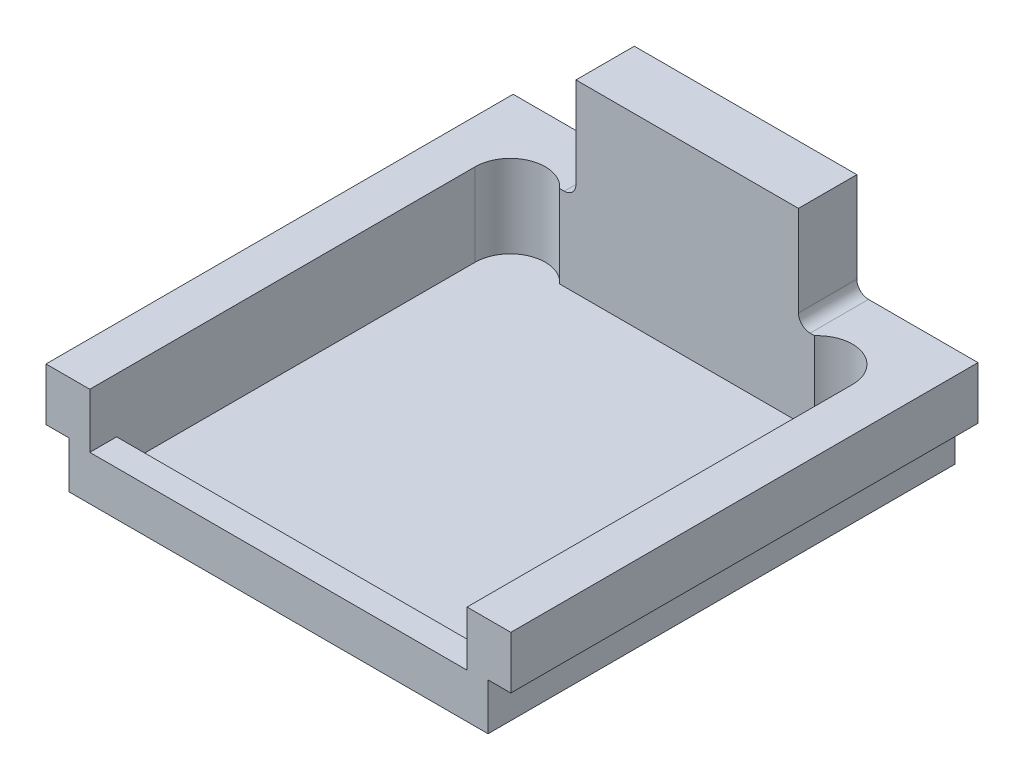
ISO-10303-21;
HEADER;
FILE_DESCRIPTION(('STEP AP214'),'2;1');
FILE_NAME('part.step','',(''),(''),'','','');
FILE_SCHEMA(('AUTOMOTIVE_DESIGN { 1 0 10303 214 1 1 1 1 }'));
ENDSEC;
DATA;
#1=APPLICATION_CONTEXT('core data for automotive mechanical design processes');
#2=APPLICATION_PROTOCOL_DEFINITION('international standard','automotive_design',2000,#1);
#3=PRODUCT_CONTEXT('',#1,'mechanical');
#4=PRODUCT('Part','Part','',(#3));
#5=PRODUCT_RELATED_PRODUCT_CATEGORY('part','',(#4));
#6=PRODUCT_DEFINITION_FORMATION('','',#4);
#7=PRODUCT_DEFINITION_CONTEXT('part definition',#1,'design');
#8=PRODUCT_DEFINITION('design','',#6,#7);
#9=PRODUCT_DEFINITION_SHAPE('','',#8);
#10=(LENGTH_UNIT() NAMED_UNIT(*) SI_UNIT(.MILLI.,.METRE.));
#11=(NAMED_UNIT(*) PLANE_ANGLE_UNIT() SI_UNIT($,.RADIAN.));
#12=(NAMED_UNIT(*) SI_UNIT($,.STERADIAN.) SOLID_ANGLE_UNIT());
#13=UNCERTAINTY_MEASURE_WITH_UNIT(LENGTH_MEASURE(1.E-05),#10,'distance_accuracy_value','');
#14=(GEOMETRIC_REPRESENTATION_CONTEXT(3) GLOBAL_UNCERTAINTY_ASSIGNED_CONTEXT((#13)) GLOBAL_UNIT_ASSIGNED_CONTEXT((#10,
#11,#12)) REPRESENTATION_CONTEXT('',''));
#15=CARTESIAN_POINT('',(0.,0.,0.));
#16=DIRECTION('',(0.,0.,1.));
#17=DIRECTION('',(1.,0.,0.));
#18=AXIS2_PLACEMENT_3D('',#15,#16,#17);
#19=CARTESIAN_POINT('',(0.,1.42,21.3132343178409));
#20=DIRECTION('',(0.,1.,0.));
#21=DIRECTION('',(0.,0.,1.));
#22=AXIS2_PLACEMENT_3D('',#19,#20,#21);
#23=PLANE('',#22);
#24=CARTESIAN_POINT('',(-13.15,1.42,7.00000000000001));
#25=DIRECTION('',(0.,-1.,0.));
#26=DIRECTION('',(0.,0.,-1.));
#27=AXIS2_PLACEMENT_3D('',#24,#25,#26);
#28=CIRCLE('',#27,3.);
#29=CARTESIAN_POINT('',(-10.9139320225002,1.42,5.));
#30=VERTEX_POINT('',#29);
#31=CARTESIAN_POINT('',(-16.15,1.42,7.00000000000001));
#32=VERTEX_POINT('',#31);
#33=EDGE_CURVE('E226',#30,#32,#28,.F.);
#34=ORIENTED_EDGE('',*,*,#33,.T.);
#35=DIRECTION('',(0.,0.,1.));
#36=VECTOR('',#35,1.);
#37=CARTESIAN_POINT('',(-16.15,1.42,7.00000000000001));
#38=LINE('',#37,#36);
#39=CARTESIAN_POINT('',(-16.15,1.42,37.7));
#40=VERTEX_POINT('',#39);
#41=EDGE_CURVE('E201',#32,#40,#38,.T.);
#42=ORIENTED_EDGE('',*,*,#41,.T.);
#43=DIRECTION('',(1.,0.,0.));
#44=VECTOR('',#43,1.);
#45=CARTESIAN_POINT('',(-16.15,1.42,37.7));
#46=LINE('',#45,#44);
#47=CARTESIAN_POINT('',(16.15,1.42,37.7));
#48=VERTEX_POINT('',#47);
#49=EDGE_CURVE('E166',#40,#48,#46,.T.);
#50=ORIENTED_EDGE('',*,*,#49,.T.);
#51=DIRECTION('',(0.,0.,-1.));
#52=VECTOR('',#51,1.);
#53=CARTESIAN_POINT('',(16.15,1.42,40.));
#54=LINE('',#53,#52);
#55=CARTESIAN_POINT('',(16.15,1.42,7.));
#56=VERTEX_POINT('',#55);
#57=EDGE_CURVE('E162',#48,#56,#54,.T.);
#58=ORIENTED_EDGE('',*,*,#57,.T.);
#59=CARTESIAN_POINT('',(13.15,1.42,7.));
#60=DIRECTION('',(0.,-1.,0.));
#61=DIRECTION('',(0.,0.,-1.));
#62=AXIS2_PLACEMENT_3D('',#59,#60,#61);
#63=CIRCLE('',#62,3.);
#64=CARTESIAN_POINT('',(10.9139320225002,1.42,5.));
#65=VERTEX_POINT('',#64);
#66=EDGE_CURVE('E19',#56,#65,#63,.F.);
#67=ORIENTED_EDGE('',*,*,#66,.T.);
#68=DIRECTION('',(-1.,0.,0.));
#69=VECTOR('',#68,1.);
#70=CARTESIAN_POINT('',(10.9139320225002,1.42,5.));
#71=LINE('',#70,#69);
#72=EDGE_CURVE('E200',#65,#30,#71,.T.);
#73=ORIENTED_EDGE('',*,*,#72,.T.);
#74=EDGE_LOOP('',(#34,#42,#50,#58,#67,#73));
#75=FACE_BOUND('',#74,.T.);
#76=ADVANCED_FACE('F16',(#75),#23,.T.);
#77=CARTESIAN_POINT('',(-16.15,3.82,37.7));
#78=DIRECTION('',(0.,0.,1.));
#79=DIRECTION('',(1.,0.,0.));
#80=AXIS2_PLACEMENT_3D('',#77,#78,#79);
#81=PLANE('',#80);
#82=DIRECTION('',(0.,1.,0.));
#83=VECTOR('',#82,1.);
#84=CARTESIAN_POINT('',(-16.15,17.25,37.7));
#85=LINE('',#84,#83);
#86=CARTESIAN_POINT('',(-16.15,3.82,37.7));
#87=VERTEX_POINT('',#86);
#88=EDGE_CURVE('E203',#40,#87,#85,.T.);
#89=ORIENTED_EDGE('',*,*,#88,.T.);
#90=DIRECTION('',(1.,0.,0.));
#91=VECTOR('',#90,1.);
#92=CARTESIAN_POINT('',(0.,3.82,37.7));
#93=LINE('',#92,#91);
#94=CARTESIAN_POINT('',(16.15,3.82,37.7));
#95=VERTEX_POINT('',#94);
#96=EDGE_CURVE('E185',#95,#87,#93,.F.);
#97=ORIENTED_EDGE('',*,*,#96,.F.);
#98=DIRECTION('',(0.,1.,0.));
#99=VECTOR('',#98,1.);
#100=CARTESIAN_POINT('',(16.15,17.25,37.7));
#101=LINE('',#100,#99);
#102=EDGE_CURVE('E172',#95,#48,#101,.F.);
#103=ORIENTED_EDGE('',*,*,#102,.T.);
#104=ORIENTED_EDGE('',*,*,#49,.F.);
#105=EDGE_LOOP('',(#89,#97,#103,#104));
#106=FACE_BOUND('',#105,.T.);
#107=ADVANCED_FACE('F399',(#106),#81,.F.);
#108=CARTESIAN_POINT('',(13.15,17.25,7.));
#109=DIRECTION('',(0.,-1.,0.));
#110=DIRECTION('',(0.,0.,-1.));
#111=AXIS2_PLACEMENT_3D('',#108,#109,#110);
#112=CYLINDRICAL_SURFACE('',#111,3.);
#113=DIRECTION('',(0.,1.,0.));
#114=VECTOR('',#113,1.);
#115=CARTESIAN_POINT('',(10.9139320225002,17.25,5.));
#116=LINE('',#115,#114);
#117=CARTESIAN_POINT('',(10.9139320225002,8.5,5.));
#118=VERTEX_POINT('',#117);
#119=EDGE_CURVE('E178',#118,#65,#116,.F.);
#120=ORIENTED_EDGE('',*,*,#119,.T.);
#121=ORIENTED_EDGE('',*,*,#66,.F.);
#122=DIRECTION('',(0.,1.,0.));
#123=VECTOR('',#122,1.);
#124=CARTESIAN_POINT('',(16.15,17.25,7.));
#125=LINE('',#124,#123);
#126=CARTESIAN_POINT('',(16.15,8.5,7.));
#127=VERTEX_POINT('',#126);
#128=EDGE_CURVE('E171',#56,#127,#125,.T.);
#129=ORIENTED_EDGE('',*,*,#128,.T.);
#130=CARTESIAN_POINT('',(13.15,8.5,7.));
#131=DIRECTION('',(0.,-1.,0.));
#132=DIRECTION('',(0.,0.,-1.));
#133=AXIS2_PLACEMENT_3D('',#130,#131,#132);
#134=CIRCLE('',#133,3.);
#135=EDGE_CURVE('E219',#118,#127,#134,.T.);
#136=ORIENTED_EDGE('',*,*,#135,.F.);
#137=EDGE_LOOP('',(#120,#121,#129,#136));
#138=FACE_BOUND('',#137,.T.);
#139=ADVANCED_FACE('F175',(#138),#112,.F.);
#140=CARTESIAN_POINT('',(10.525,9.5,0.));
#141=DIRECTION('',(0.,0.,1.));
#142=DIRECTION('',(1.,0.,0.));
#143=AXIS2_PLACEMENT_3D('',#140,#141,#142);
#144=CYLINDRICAL_SURFACE('',#143,1.);
#145=DIRECTION('',(0.,0.,1.));
#146=VECTOR('',#145,1.);
#147=CARTESIAN_POINT('',(10.525,8.5,0.));
#148=LINE('',#147,#146);
#149=CARTESIAN_POINT('',(10.525,8.5,0.));
#150=VERTEX_POINT('',#149);
#151=CARTESIAN_POINT('',(10.525,8.5,5.));
#152=VERTEX_POINT('',#151);
#153=EDGE_CURVE('E244',#150,#152,#148,.T.);
#154=ORIENTED_EDGE('',*,*,#153,.F.);
#155=CARTESIAN_POINT('',(10.525,9.5,0.));
#156=DIRECTION('',(0.,0.,1.));
#157=DIRECTION('',(1.,0.,0.));
#158=AXIS2_PLACEMENT_3D('',#155,#156,#157);
#159=CIRCLE('',#158,1.);
#160=CARTESIAN_POINT('',(9.525,9.5,0.));
#161=VERTEX_POINT('',#160);
#162=EDGE_CURVE('E180',#161,#150,#159,.T.);
#163=ORIENTED_EDGE('',*,*,#162,.F.);
#164=DIRECTION('',(0.,0.,-1.));
#165=VECTOR('',#164,1.);
#166=CARTESIAN_POINT('',(9.525,9.5,0.));
#167=LINE('',#166,#165);
#168=CARTESIAN_POINT('',(9.525,9.5,5.));
#169=VERTEX_POINT('',#168);
#170=EDGE_CURVE('E303',#169,#161,#167,.T.);
#171=ORIENTED_EDGE('',*,*,#170,.F.);
#172=CARTESIAN_POINT('',(10.525,9.5,5.));
#173=DIRECTION('',(0.,0.,1.));
#174=DIRECTION('',(1.,0.,0.));
#175=AXIS2_PLACEMENT_3D('',#172,#173,#174);
#176=CIRCLE('',#175,1.);
#177=EDGE_CURVE('E229',#169,#152,#176,.T.);
#178=ORIENTED_EDGE('',*,*,#177,.T.);
#179=EDGE_LOOP('',(#154,#163,#171,#178));
#180=FACE_BOUND('',#179,.T.);
#181=ADVANCED_FACE('F245',(#180),#144,.F.);
#182=CARTESIAN_POINT('',(10.9139320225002,17.25,5.));
#183=DIRECTION('',(0.,0.,-1.));
#184=DIRECTION('',(-1.,0.,0.));
#185=AXIS2_PLACEMENT_3D('',#182,#183,#184);
#186=PLANE('',#185);
#187=ORIENTED_EDGE('',*,*,#177,.F.);
#188=DIRECTION('',(0.,1.,0.));
#189=VECTOR('',#188,1.);
#190=CARTESIAN_POINT('',(9.525,17.25,5.));
#191=LINE('',#190,#189);
#192=CARTESIAN_POINT('',(9.525,17.25,5.));
#193=VERTEX_POINT('',#192);
#194=EDGE_CURVE('E249',#193,#169,#191,.F.);
#195=ORIENTED_EDGE('',*,*,#194,.F.);
#196=DIRECTION('',(1.,0.,0.));
#197=VECTOR('',#196,1.);
#198=CARTESIAN_POINT('',(-9.525,17.25,5.));
#199=LINE('',#198,#197);
#200=CARTESIAN_POINT('',(-9.525,17.25,5.));
#201=VERTEX_POINT('',#200);
#202=EDGE_CURVE('E302',#201,#193,#199,.T.);
#203=ORIENTED_EDGE('',*,*,#202,.F.);
#204=DIRECTION('',(0.,1.,0.));
#205=VECTOR('',#204,1.);
#206=CARTESIAN_POINT('',(-9.525,9.5,5.));
#207=LINE('',#206,#205);
#208=CARTESIAN_POINT('',(-9.525,9.5,5.));
#209=VERTEX_POINT('',#208);
#210=EDGE_CURVE('E296',#209,#201,#207,.T.);
#211=ORIENTED_EDGE('',*,*,#210,.F.);
#212=CARTESIAN_POINT('',(-10.525,9.5,5.));
#213=DIRECTION('',(0.,0.,1.));
#214=DIRECTION('',(1.,0.,0.));
#215=AXIS2_PLACEMENT_3D('',#212,#213,#214);
#216=CIRCLE('',#215,1.);
#217=CARTESIAN_POINT('',(-10.525,8.5,5.));
#218=VERTEX_POINT('',#217);
#219=EDGE_CURVE('E208',#209,#218,#216,.F.);
#220=ORIENTED_EDGE('',*,*,#219,.T.);
#221=DIRECTION('',(-1.,0.,0.));
#222=VECTOR('',#221,1.);
#223=CARTESIAN_POINT('',(10.9139320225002,8.5,5.));
#224=LINE('',#223,#222);
#225=CARTESIAN_POINT('',(-10.9139320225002,8.5,5.));
#226=VERTEX_POINT('',#225);
#227=EDGE_CURVE('E213',#226,#218,#224,.F.);
#228=ORIENTED_EDGE('',*,*,#227,.F.);
#229=DIRECTION('',(0.,-1.,0.));
#230=VECTOR('',#229,1.);
#231=CARTESIAN_POINT('',(-10.9139320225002,17.25,5.));
#232=LINE('',#231,#230);
#233=EDGE_CURVE('E228',#226,#30,#232,.T.);
#234=ORIENTED_EDGE('',*,*,#233,.T.);
#235=ORIENTED_EDGE('',*,*,#72,.F.);
#236=ORIENTED_EDGE('',*,*,#119,.F.);
#237=DIRECTION('',(1.,0.,0.));
#238=VECTOR('',#237,1.);
#239=CARTESIAN_POINT('',(10.525,8.5,5.));
#240=LINE('',#239,#238);
#241=EDGE_CURVE('E221',#152,#118,#240,.T.);
#242=ORIENTED_EDGE('',*,*,#241,.F.);
#243=EDGE_LOOP('',(#187,#195,#203,#211,#220,#228,#234,#235,#236,#242));
#244=FACE_BOUND('',#243,.T.);
#245=ADVANCED_FACE('F343',(#244),#186,.F.);
#246=CARTESIAN_POINT('',(-13.15,17.25,7.00000000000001));
#247=DIRECTION('',(0.,-1.,0.));
#248=DIRECTION('',(0.,0.,-1.));
#249=AXIS2_PLACEMENT_3D('',#246,#247,#248);
#250=CYLINDRICAL_SURFACE('',#249,3.);
#251=DIRECTION('',(0.,1.,0.));
#252=VECTOR('',#251,1.);
#253=CARTESIAN_POINT('',(-16.15,17.25,7.00000000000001));
#254=LINE('',#253,#252);
#255=CARTESIAN_POINT('',(-16.15,8.5,7.00000000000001));
#256=VERTEX_POINT('',#255);
#257=EDGE_CURVE('E204',#256,#32,#254,.F.);
#258=ORIENTED_EDGE('',*,*,#257,.T.);
#259=ORIENTED_EDGE('',*,*,#33,.F.);
#260=ORIENTED_EDGE('',*,*,#233,.F.);
#261=CARTESIAN_POINT('',(-13.15,8.5,7.00000000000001));
#262=DIRECTION('',(0.,-1.,0.));
#263=DIRECTION('',(0.,0.,-1.));
#264=AXIS2_PLACEMENT_3D('',#261,#262,#263);
#265=CIRCLE('',#264,3.);
#266=EDGE_CURVE('E214',#256,#226,#265,.T.);
#267=ORIENTED_EDGE('',*,*,#266,.F.);
#268=EDGE_LOOP('',(#258,#259,#260,#267));
#269=FACE_BOUND('',#268,.T.);
#270=ADVANCED_FACE('F389',(#269),#250,.F.);
#271=CARTESIAN_POINT('',(-10.525,9.5,0.));
#272=DIRECTION('',(0.,0.,1.));
#273=DIRECTION('',(1.,0.,0.));
#274=AXIS2_PLACEMENT_3D('',#271,#272,#273);
#275=CYLINDRICAL_SURFACE('',#274,1.);
#276=DIRECTION('',(0.,0.,1.));
#277=VECTOR('',#276,1.);
#278=CARTESIAN_POINT('',(-9.525,9.5,0.));
#279=LINE('',#278,#277);
#280=CARTESIAN_POINT('',(-9.525,9.5,0.));
#281=VERTEX_POINT('',#280);
#282=EDGE_CURVE('E282',#281,#209,#279,.T.);
#283=ORIENTED_EDGE('',*,*,#282,.F.);
#284=CARTESIAN_POINT('',(-10.525,9.5,0.));
#285=DIRECTION('',(0.,0.,1.));
#286=DIRECTION('',(1.,0.,0.));
#287=AXIS2_PLACEMENT_3D('',#284,#285,#286);
#288=CIRCLE('',#287,1.);
#289=CARTESIAN_POINT('',(-10.525,8.5,0.));
#290=VERTEX_POINT('',#289);
#291=EDGE_CURVE('E224',#290,#281,#288,.T.);
#292=ORIENTED_EDGE('',*,*,#291,.F.);
#293=DIRECTION('',(0.,0.,1.));
#294=VECTOR('',#293,1.);
#295=CARTESIAN_POINT('',(-10.525,8.5,0.));
#296=LINE('',#295,#294);
#297=EDGE_CURVE('E217',#218,#290,#296,.F.);
#298=ORIENTED_EDGE('',*,*,#297,.F.);
#299=ORIENTED_EDGE('',*,*,#219,.F.);
#300=EDGE_LOOP('',(#283,#292,#298,#299));
#301=FACE_BOUND('',#300,.T.);
#302=ADVANCED_FACE('F383',(#301),#275,.F.);
#303=CARTESIAN_POINT('',(16.15,17.25,40.));
#304=DIRECTION('',(1.,0.,0.));
#305=DIRECTION('',(0.,0.,-1.));
#306=AXIS2_PLACEMENT_3D('',#303,#304,#305);
#307=PLANE('',#306);
#308=ORIENTED_EDGE('',*,*,#128,.F.);
#309=ORIENTED_EDGE('',*,*,#57,.F.);
#310=ORIENTED_EDGE('',*,*,#102,.F.);
#311=DIRECTION('',(0.,0.,1.));
#312=VECTOR('',#311,1.);
#313=CARTESIAN_POINT('',(16.15,3.82,22.4644988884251));
#314=LINE('',#313,#312);
#315=CARTESIAN_POINT('',(16.15,3.82,40.));
#316=VERTEX_POINT('',#315);
#317=EDGE_CURVE('E188',#316,#95,#314,.F.);
#318=ORIENTED_EDGE('',*,*,#317,.F.);
#319=DIRECTION('',(0.,1.,0.));
#320=VECTOR('',#319,1.);
#321=CARTESIAN_POINT('',(16.15,7.16201414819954,40.));
#322=LINE('',#321,#320);
#323=CARTESIAN_POINT('',(16.15,8.5,40.));
#324=VERTEX_POINT('',#323);
#325=EDGE_CURVE('E194',#324,#316,#322,.F.);
#326=ORIENTED_EDGE('',*,*,#325,.F.);
#327=DIRECTION('',(0.,0.,1.));
#328=VECTOR('',#327,1.);
#329=CARTESIAN_POINT('',(16.15,8.5,0.));
#330=LINE('',#329,#328);
#331=EDGE_CURVE('E183',#127,#324,#330,.T.);
#332=ORIENTED_EDGE('',*,*,#331,.F.);
#333=EDGE_LOOP('',(#308,#309,#310,#318,#326,#332));
#334=FACE_BOUND('',#333,.T.);
#335=ADVANCED_FACE('F181',(#334),#307,.F.);
#336=CARTESIAN_POINT('',(0.,3.82,22.4644988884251));
#337=DIRECTION('',(0.,1.,0.));
#338=DIRECTION('',(0.,0.,1.));
#339=AXIS2_PLACEMENT_3D('',#336,#337,#338);
#340=PLANE('',#339);
#341=DIRECTION('',(1.,0.,0.));
#342=VECTOR('',#341,1.);
#343=CARTESIAN_POINT('',(0.,3.82,40.));
#344=LINE('',#343,#342);
#345=CARTESIAN_POINT('',(-16.15,3.82,40.));
#346=VERTEX_POINT('',#345);
#347=EDGE_CURVE('E197',#316,#346,#344,.F.);
#348=ORIENTED_EDGE('',*,*,#347,.F.);
#349=ORIENTED_EDGE('',*,*,#317,.T.);
#350=ORIENTED_EDGE('',*,*,#96,.T.);
#351=DIRECTION('',(0.,0.,1.));
#352=VECTOR('',#351,1.);
#353=CARTESIAN_POINT('',(-16.15,3.82,7.00000000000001));
#354=LINE('',#353,#352);
#355=EDGE_CURVE('E206',#87,#346,#354,.T.);
#356=ORIENTED_EDGE('',*,*,#355,.T.);
#357=EDGE_LOOP('',(#348,#349,#350,#356));
#358=FACE_BOUND('',#357,.T.);
#359=ADVANCED_FACE('F402',(#358),#340,.T.);
#360=CARTESIAN_POINT('',(-16.15,17.25,7.00000000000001));
#361=DIRECTION('',(-1.,0.,0.));
#362=DIRECTION('',(0.,0.,1.));
#363=AXIS2_PLACEMENT_3D('',#360,#361,#362);
#364=PLANE('',#363);
#365=DIRECTION('',(0.,1.,0.));
#366=VECTOR('',#365,1.);
#367=CARTESIAN_POINT('',(-16.15,7.16201414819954,40.));
#368=LINE('',#367,#366);
#369=CARTESIAN_POINT('',(-16.15,8.5,40.));
#370=VERTEX_POINT('',#369);
#371=EDGE_CURVE('E275',#346,#370,#368,.T.);
#372=ORIENTED_EDGE('',*,*,#371,.F.);
#373=ORIENTED_EDGE('',*,*,#355,.F.);
#374=ORIENTED_EDGE('',*,*,#88,.F.);
#375=ORIENTED_EDGE('',*,*,#41,.F.);
#376=ORIENTED_EDGE('',*,*,#257,.F.);
#377=DIRECTION('',(0.,0.,1.));
#378=VECTOR('',#377,1.);
#379=CARTESIAN_POINT('',(-16.15,8.5,0.));
#380=LINE('',#379,#378);
#381=EDGE_CURVE('E218',#370,#256,#380,.F.);
#382=ORIENTED_EDGE('',*,*,#381,.F.);
#383=EDGE_LOOP('',(#372,#373,#374,#375,#376,#382));
#384=FACE_BOUND('',#383,.T.);
#385=ADVANCED_FACE('F394',(#384),#364,.F.);
#386=CARTESIAN_POINT('',(19.9,8.5,0.));
#387=DIRECTION('',(1.,0.,0.));
#388=DIRECTION('',(0.,0.,-1.));
#389=AXIS2_PLACEMENT_3D('',#386,#387,#388);
#390=PLANE('',#389);
#391=DIRECTION('',(0.,1.,0.));
#392=VECTOR('',#391,1.);
#393=CARTESIAN_POINT('',(19.9,7.16201414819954,0.));
#394=LINE('',#393,#392);
#395=CARTESIAN_POINT('',(19.9,4.,0.));
#396=VERTEX_POINT('',#395);
#397=CARTESIAN_POINT('',(19.9,8.5,0.));
#398=VERTEX_POINT('',#397);
#399=EDGE_CURVE('E255',#396,#398,#394,.T.);
#400=ORIENTED_EDGE('',*,*,#399,.T.);
#401=DIRECTION('',(0.,0.,1.));
#402=VECTOR('',#401,1.);
#403=CARTESIAN_POINT('',(19.9,8.5,0.));
#404=LINE('',#403,#402);
#405=CARTESIAN_POINT('',(19.9,8.5,40.));
#406=VERTEX_POINT('',#405);
#407=EDGE_CURVE('E250',#406,#398,#404,.F.);
#408=ORIENTED_EDGE('',*,*,#407,.F.);
#409=DIRECTION('',(0.,1.,0.));
#410=VECTOR('',#409,1.);
#411=CARTESIAN_POINT('',(19.9,7.16201414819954,40.));
#412=LINE('',#411,#410);
#413=CARTESIAN_POINT('',(19.9,4.,40.));
#414=VERTEX_POINT('',#413);
#415=EDGE_CURVE('E318',#414,#406,#412,.T.);
#416=ORIENTED_EDGE('',*,*,#415,.F.);
#417=DIRECTION('',(0.,0.,-1.));
#418=VECTOR('',#417,1.);
#419=CARTESIAN_POINT('',(19.9,4.,0.));
#420=LINE('',#419,#418);
#421=EDGE_CURVE('E198',#396,#414,#420,.F.);
#422=ORIENTED_EDGE('',*,*,#421,.F.);
#423=EDGE_LOOP('',(#400,#408,#416,#422));
#424=FACE_BOUND('',#423,.T.);
#425=ADVANCED_FACE('F351',(#424),#390,.T.);
#426=CARTESIAN_POINT('',(10.525,8.5,0.));
#427=DIRECTION('',(0.,1.,0.));
#428=DIRECTION('',(0.,0.,1.));
#429=AXIS2_PLACEMENT_3D('',#426,#427,#428);
#430=PLANE('',#429);
#431=DIRECTION('',(1.,0.,0.));
#432=VECTOR('',#431,1.);
#433=CARTESIAN_POINT('',(0.,8.5,0.));
#434=LINE('',#433,#432);
#435=EDGE_CURVE('E237',#398,#150,#434,.F.);
#436=ORIENTED_EDGE('',*,*,#435,.T.);
#437=ORIENTED_EDGE('',*,*,#153,.T.);
#438=ORIENTED_EDGE('',*,*,#241,.T.);
#439=ORIENTED_EDGE('',*,*,#135,.T.);
#440=ORIENTED_EDGE('',*,*,#331,.T.);
#441=DIRECTION('',(1.,0.,0.));
#442=VECTOR('',#441,1.);
#443=CARTESIAN_POINT('',(0.,8.5,40.));
#444=LINE('',#443,#442);
#445=EDGE_CURVE('E192',#406,#324,#444,.F.);
#446=ORIENTED_EDGE('',*,*,#445,.F.);
#447=ORIENTED_EDGE('',*,*,#407,.T.);
#448=EDGE_LOOP('',(#436,#437,#438,#439,#440,#446,#447));
#449=FACE_BOUND('',#448,.T.);
#450=ADVANCED_FACE('F253',(#449),#430,.T.);
#451=CARTESIAN_POINT('',(9.525,17.25,0.));
#452=DIRECTION('',(1.,0.,0.));
#453=DIRECTION('',(0.,0.,-1.));
#454=AXIS2_PLACEMENT_3D('',#451,#452,#453);
#455=PLANE('',#454);
#456=DIRECTION('',(0.,1.,0.));
#457=VECTOR('',#456,1.);
#458=CARTESIAN_POINT('',(9.525,7.16201414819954,0.));
#459=LINE('',#458,#457);
#460=CARTESIAN_POINT('',(9.525,17.25,0.));
#461=VERTEX_POINT('',#460);
#462=EDGE_CURVE('E239',#161,#461,#459,.T.);
#463=ORIENTED_EDGE('',*,*,#462,.T.);
#464=DIRECTION('',(0.,0.,1.));
#465=VECTOR('',#464,1.);
#466=CARTESIAN_POINT('',(9.525,17.25,0.));
#467=LINE('',#466,#465);
#468=EDGE_CURVE('E299',#193,#461,#467,.F.);
#469=ORIENTED_EDGE('',*,*,#468,.F.);
#470=ORIENTED_EDGE('',*,*,#194,.T.);
#471=ORIENTED_EDGE('',*,*,#170,.T.);
#472=EDGE_LOOP('',(#463,#469,#470,#471));
#473=FACE_BOUND('',#472,.T.);
#474=ADVANCED_FACE('F341',(#473),#455,.T.);
#475=CARTESIAN_POINT('',(-9.525,17.25,0.));
#476=DIRECTION('',(0.,1.,0.));
#477=DIRECTION('',(0.,0.,1.));
#478=AXIS2_PLACEMENT_3D('',#475,#476,#477);
#479=PLANE('',#478);
#480=DIRECTION('',(1.,0.,0.));
#481=VECTOR('',#480,1.);
#482=CARTESIAN_POINT('',(0.,17.25,0.));
#483=LINE('',#482,#481);
#484=CARTESIAN_POINT('',(-9.525,17.25,0.));
#485=VERTEX_POINT('',#484);
#486=EDGE_CURVE('E257',#461,#485,#483,.F.);
#487=ORIENTED_EDGE('',*,*,#486,.T.);
#488=DIRECTION('',(0.,0.,1.));
#489=VECTOR('',#488,1.);
#490=CARTESIAN_POINT('',(-9.525,17.25,0.));
#491=LINE('',#490,#489);
#492=EDGE_CURVE('E293',#201,#485,#491,.F.);
#493=ORIENTED_EDGE('',*,*,#492,.F.);
#494=ORIENTED_EDGE('',*,*,#202,.T.);
#495=ORIENTED_EDGE('',*,*,#468,.T.);
#496=EDGE_LOOP('',(#487,#493,#494,#495));
#497=FACE_BOUND('',#496,.T.);
#498=ADVANCED_FACE('F476',(#497),#479,.T.);
#499=CARTESIAN_POINT('',(-9.525,9.5,0.));
#500=DIRECTION('',(-1.,0.,0.));
#501=DIRECTION('',(0.,0.,1.));
#502=AXIS2_PLACEMENT_3D('',#499,#500,#501);
#503=PLANE('',#502);
#504=DIRECTION('',(0.,1.,0.));
#505=VECTOR('',#504,1.);
#506=CARTESIAN_POINT('',(-9.525,7.16201414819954,0.));
#507=LINE('',#506,#505);
#508=EDGE_CURVE('E298',#485,#281,#507,.F.);
#509=ORIENTED_EDGE('',*,*,#508,.T.);
#510=ORIENTED_EDGE('',*,*,#282,.T.);
#511=ORIENTED_EDGE('',*,*,#210,.T.);
#512=ORIENTED_EDGE('',*,*,#492,.T.);
#513=EDGE_LOOP('',(#509,#510,#511,#512));
#514=FACE_BOUND('',#513,.T.);
#515=ADVANCED_FACE('F376',(#514),#503,.T.);
#516=CARTESIAN_POINT('',(-19.9,8.5,0.));
#517=DIRECTION('',(0.,1.,0.));
#518=DIRECTION('',(0.,0.,1.));
#519=AXIS2_PLACEMENT_3D('',#516,#517,#518);
#520=PLANE('',#519);
#521=DIRECTION('',(0.,0.,1.));
#522=VECTOR('',#521,1.);
#523=CARTESIAN_POINT('',(-19.9,8.5,0.));
#524=LINE('',#523,#522);
#525=CARTESIAN_POINT('',(-19.9,8.5,40.));
#526=VERTEX_POINT('',#525);
#527=CARTESIAN_POINT('',(-19.9,8.5,0.));
#528=VERTEX_POINT('',#527);
#529=EDGE_CURVE('E279',#526,#528,#524,.F.);
#530=ORIENTED_EDGE('',*,*,#529,.F.);
#531=DIRECTION('',(1.,0.,0.));
#532=VECTOR('',#531,1.);
#533=CARTESIAN_POINT('',(0.,8.5,40.));
#534=LINE('',#533,#532);
#535=EDGE_CURVE('E325',#370,#526,#534,.F.);
#536=ORIENTED_EDGE('',*,*,#535,.F.);
#537=ORIENTED_EDGE('',*,*,#381,.T.);
#538=ORIENTED_EDGE('',*,*,#266,.T.);
#539=ORIENTED_EDGE('',*,*,#227,.T.);
#540=ORIENTED_EDGE('',*,*,#297,.T.);
#541=DIRECTION('',(1.,0.,0.));
#542=VECTOR('',#541,1.);
#543=CARTESIAN_POINT('',(0.,8.5,0.));
#544=LINE('',#543,#542);
#545=EDGE_CURVE('E290',#290,#528,#544,.F.);
#546=ORIENTED_EDGE('',*,*,#545,.T.);
#547=EDGE_LOOP('',(#530,#536,#537,#538,#539,#540,#546));
#548=FACE_BOUND('',#547,.T.);
#549=ADVANCED_FACE('F390',(#548),#520,.T.);
#550=CARTESIAN_POINT('',(-19.9,4.,0.));
#551=DIRECTION('',(-1.,0.,0.));
#552=DIRECTION('',(0.,0.,1.));
#553=AXIS2_PLACEMENT_3D('',#550,#551,#552);
#554=PLANE('',#553);
#555=DIRECTION('',(0.,1.,0.));
#556=VECTOR('',#555,1.);
#557=CARTESIAN_POINT('',(-19.9,7.16201414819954,0.));
#558=LINE('',#557,#556);
#559=CARTESIAN_POINT('',(-19.9,4.,0.));
#560=VERTEX_POINT('',#559);
#561=EDGE_CURVE('E287',#528,#560,#558,.F.);
#562=ORIENTED_EDGE('',*,*,#561,.T.);
#563=DIRECTION('',(0.,0.,-1.));
#564=VECTOR('',#563,1.);
#565=CARTESIAN_POINT('',(-19.9,4.,0.));
#566=LINE('',#565,#564);
#567=CARTESIAN_POINT('',(-19.9,4.,40.));
#568=VERTEX_POINT('',#567);
#569=EDGE_CURVE('E276',#568,#560,#566,.T.);
#570=ORIENTED_EDGE('',*,*,#569,.F.);
#571=DIRECTION('',(0.,1.,0.));
#572=VECTOR('',#571,1.);
#573=CARTESIAN_POINT('',(-19.9,7.16201414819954,40.));
#574=LINE('',#573,#572);
#575=EDGE_CURVE('E272',#526,#568,#574,.F.);
#576=ORIENTED_EDGE('',*,*,#575,.F.);
#577=ORIENTED_EDGE('',*,*,#529,.T.);
#578=EDGE_LOOP('',(#562,#570,#576,#577));
#579=FACE_BOUND('',#578,.T.);
#580=ADVANCED_FACE('F407',(#579),#554,.T.);
#581=CARTESIAN_POINT('',(-17.95,4.,0.));
#582=DIRECTION('',(0.,-1.,0.));
#583=DIRECTION('',(0.,0.,-1.));
#584=AXIS2_PLACEMENT_3D('',#581,#582,#583);
#585=PLANE('',#584);
#586=DIRECTION('',(1.,0.,0.));
#587=VECTOR('',#586,1.);
#588=CARTESIAN_POINT('',(0.,4.,0.));
#589=LINE('',#588,#587);
#590=CARTESIAN_POINT('',(-17.95,4.,0.));
#591=VERTEX_POINT('',#590);
#592=EDGE_CURVE('E289',#560,#591,#589,.T.);
#593=ORIENTED_EDGE('',*,*,#592,.T.);
#594=DIRECTION('',(0.,0.,1.));
#595=VECTOR('',#594,1.);
#596=CARTESIAN_POINT('',(-17.95,4.,0.));
#597=LINE('',#596,#595);
#598=CARTESIAN_POINT('',(-17.95,4.,40.));
#599=VERTEX_POINT('',#598);
#600=EDGE_CURVE('E263',#599,#591,#597,.F.);
#601=ORIENTED_EDGE('',*,*,#600,.F.);
#602=DIRECTION('',(1.,0.,0.));
#603=VECTOR('',#602,1.);
#604=CARTESIAN_POINT('',(0.,4.,40.));
#605=LINE('',#604,#603);
#606=EDGE_CURVE('E269',#568,#599,#605,.T.);
#607=ORIENTED_EDGE('',*,*,#606,.F.);
#608=ORIENTED_EDGE('',*,*,#569,.T.);
#609=EDGE_LOOP('',(#593,#601,#607,#608));
#610=FACE_BOUND('',#609,.T.);
#611=ADVANCED_FACE('F410',(#610),#585,.T.);
#612=CARTESIAN_POINT('',(19.9,4.,0.));
#613=DIRECTION('',(0.,-1.,0.));
#614=DIRECTION('',(0.,0.,-1.));
#615=AXIS2_PLACEMENT_3D('',#612,#613,#614);
#616=PLANE('',#615);
#617=DIRECTION('',(1.,0.,0.));
#618=VECTOR('',#617,1.);
#619=CARTESIAN_POINT('',(0.,4.,0.));
#620=LINE('',#619,#618);
#621=CARTESIAN_POINT('',(17.95,4.,0.));
#622=VERTEX_POINT('',#621);
#623=EDGE_CURVE('E259',#622,#396,#620,.T.);
#624=ORIENTED_EDGE('',*,*,#623,.T.);
#625=ORIENTED_EDGE('',*,*,#421,.T.);
#626=DIRECTION('',(1.,0.,0.));
#627=VECTOR('',#626,1.);
#628=CARTESIAN_POINT('',(0.,4.,40.));
#629=LINE('',#628,#627);
#630=CARTESIAN_POINT('',(17.95,4.,40.));
#631=VERTEX_POINT('',#630);
#632=EDGE_CURVE('E271',#631,#414,#629,.T.);
#633=ORIENTED_EDGE('',*,*,#632,.F.);
#634=DIRECTION('',(0.,0.,-1.));
#635=VECTOR('',#634,1.);
#636=CARTESIAN_POINT('',(17.95,4.,0.));
#637=LINE('',#636,#635);
#638=EDGE_CURVE('E311',#622,#631,#637,.F.);
#639=ORIENTED_EDGE('',*,*,#638,.F.);
#640=EDGE_LOOP('',(#624,#625,#633,#639));
#641=FACE_BOUND('',#640,.T.);
#642=ADVANCED_FACE('F354',(#641),#616,.T.);
#643=CARTESIAN_POINT('',(0.,7.16201414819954,40.));
#644=DIRECTION('',(0.,0.,1.));
#645=DIRECTION('',(1.,0.,0.));
#646=AXIS2_PLACEMENT_3D('',#643,#644,#645);
#647=PLANE('',#646);
#648=ORIENTED_EDGE('',*,*,#415,.T.);
#649=ORIENTED_EDGE('',*,*,#445,.T.);
#650=ORIENTED_EDGE('',*,*,#325,.T.);
#651=ORIENTED_EDGE('',*,*,#347,.T.);
#652=ORIENTED_EDGE('',*,*,#371,.T.);
#653=ORIENTED_EDGE('',*,*,#535,.T.);
#654=ORIENTED_EDGE('',*,*,#575,.T.);
#655=ORIENTED_EDGE('',*,*,#606,.T.);
#656=DIRECTION('',(0.,1.,0.));
#657=VECTOR('',#656,1.);
#658=CARTESIAN_POINT('',(-17.95,0.,40.));
#659=LINE('',#658,#657);
#660=CARTESIAN_POINT('',(-17.95,0.,40.));
#661=VERTEX_POINT('',#660);
#662=EDGE_CURVE('E266',#661,#599,#659,.T.);
#663=ORIENTED_EDGE('',*,*,#662,.F.);
#664=DIRECTION('',(1.,0.,0.));
#665=VECTOR('',#664,1.);
#666=CARTESIAN_POINT('',(17.95,0.,40.));
#667=LINE('',#666,#665);
#668=CARTESIAN_POINT('',(17.95,0.,40.));
#669=VERTEX_POINT('',#668);
#670=EDGE_CURVE('E314',#669,#661,#667,.F.);
#671=ORIENTED_EDGE('',*,*,#670,.F.);
#672=DIRECTION('',(0.,1.,0.));
#673=VECTOR('',#672,1.);
#674=CARTESIAN_POINT('',(17.95,4.,40.));
#675=LINE('',#674,#673);
#676=EDGE_CURVE('E316',#631,#669,#675,.F.);
#677=ORIENTED_EDGE('',*,*,#676,.F.);
#678=ORIENTED_EDGE('',*,*,#632,.T.);
#679=EDGE_LOOP('',(#648,#649,#650,#651,#652,#653,#654,#655,#663,#671,#677,#678));
#680=FACE_BOUND('',#679,.T.);
#681=ADVANCED_FACE('F347',(#680),#647,.T.);
#682=CARTESIAN_POINT('',(-17.95,0.,0.));
#683=DIRECTION('',(-1.,0.,0.));
#684=DIRECTION('',(0.,0.,1.));
#685=AXIS2_PLACEMENT_3D('',#682,#683,#684);
#686=PLANE('',#685);
#687=DIRECTION('',(0.,1.,0.));
#688=VECTOR('',#687,1.);
#689=CARTESIAN_POINT('',(-17.95,7.16201414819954,0.));
#690=LINE('',#689,#688);
#691=CARTESIAN_POINT('',(-17.95,0.,0.));
#692=VERTEX_POINT('',#691);
#693=EDGE_CURVE('E370',#591,#692,#690,.F.);
#694=ORIENTED_EDGE('',*,*,#693,.T.);
#695=DIRECTION('',(0.,0.,-1.));
#696=VECTOR('',#695,1.);
#697=CARTESIAN_POINT('',(-17.95,0.,0.));
#698=LINE('',#697,#696);
#699=EDGE_CURVE('E364',#661,#692,#698,.T.);
#700=ORIENTED_EDGE('',*,*,#699,.F.);
#701=ORIENTED_EDGE('',*,*,#662,.T.);
#702=ORIENTED_EDGE('',*,*,#600,.T.);
#703=EDGE_LOOP('',(#694,#700,#701,#702));
#704=FACE_BOUND('',#703,.T.);
#705=ADVANCED_FACE('F412',(#704),#686,.T.);
#706=CARTESIAN_POINT('',(0.,7.16201414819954,0.));
#707=DIRECTION('',(0.,0.,1.));
#708=DIRECTION('',(1.,0.,0.));
#709=AXIS2_PLACEMENT_3D('',#706,#707,#708);
#710=PLANE('',#709);
#711=ORIENTED_EDGE('',*,*,#693,.F.);
#712=ORIENTED_EDGE('',*,*,#592,.F.);
#713=ORIENTED_EDGE('',*,*,#561,.F.);
#714=ORIENTED_EDGE('',*,*,#545,.F.);
#715=ORIENTED_EDGE('',*,*,#291,.T.);
#716=ORIENTED_EDGE('',*,*,#508,.F.);
#717=ORIENTED_EDGE('',*,*,#486,.F.);
#718=ORIENTED_EDGE('',*,*,#462,.F.);
#719=ORIENTED_EDGE('',*,*,#162,.T.);
#720=ORIENTED_EDGE('',*,*,#435,.F.);
#721=ORIENTED_EDGE('',*,*,#399,.F.);
#722=ORIENTED_EDGE('',*,*,#623,.F.);
#723=DIRECTION('',(0.,1.,0.));
#724=VECTOR('',#723,1.);
#725=CARTESIAN_POINT('',(17.95,4.,0.));
#726=LINE('',#725,#724);
#727=CARTESIAN_POINT('',(17.95,0.,0.));
#728=VERTEX_POINT('',#727);
#729=EDGE_CURVE('E34',#728,#622,#726,.T.);
#730=ORIENTED_EDGE('',*,*,#729,.F.);
#731=DIRECTION('',(1.,0.,0.));
#732=VECTOR('',#731,1.);
#733=CARTESIAN_POINT('',(17.95,0.,0.));
#734=LINE('',#733,#732);
#735=EDGE_CURVE('E25',#692,#728,#734,.T.);
#736=ORIENTED_EDGE('',*,*,#735,.F.);
#737=EDGE_LOOP('',(#711,#712,#713,#714,#715,#716,#717,#718,#719,#720,#721,#722,#730,#736));
#738=FACE_BOUND('',#737,.T.);
#739=ADVANCED_FACE('F234',(#738),#710,.F.);
#740=CARTESIAN_POINT('',(17.95,4.,0.));
#741=DIRECTION('',(1.,0.,0.));
#742=DIRECTION('',(0.,0.,-1.));
#743=AXIS2_PLACEMENT_3D('',#740,#741,#742);
#744=PLANE('',#743);
#745=ORIENTED_EDGE('',*,*,#729,.T.);
#746=ORIENTED_EDGE('',*,*,#638,.T.);
#747=ORIENTED_EDGE('',*,*,#676,.T.);
#748=DIRECTION('',(0.,0.,-1.));
#749=VECTOR('',#748,1.);
#750=CARTESIAN_POINT('',(17.95,0.,0.));
#751=LINE('',#750,#749);
#752=EDGE_CURVE('E11',#728,#669,#751,.F.);
#753=ORIENTED_EDGE('',*,*,#752,.F.);
#754=EDGE_LOOP('',(#745,#746,#747,#753));
#755=FACE_BOUND('',#754,.T.);
#756=ADVANCED_FACE('F357',(#755),#744,.T.);
#757=CARTESIAN_POINT('',(17.95,0.,0.));
#758=DIRECTION('',(0.,-1.,0.));
#759=DIRECTION('',(0.,0.,-1.));
#760=AXIS2_PLACEMENT_3D('',#757,#758,#759);
#761=PLANE('',#760);
#762=ORIENTED_EDGE('',*,*,#735,.T.);
#763=ORIENTED_EDGE('',*,*,#752,.T.);
#764=ORIENTED_EDGE('',*,*,#670,.T.);
#765=ORIENTED_EDGE('',*,*,#699,.T.);
#766=EDGE_LOOP('',(#762,#763,#764,#765));
#767=FACE_BOUND('',#766,.T.);
#768=ADVANCED_FACE('F362',(#767),#761,.T.);
#769=CLOSED_SHELL('',(#76,#107,#139,#181,#245,#270,#302,#335,#359,#385,#425,#450,#474,#498,#515,
#549,#580,#611,#642,#681,#705,#739,#756,#768));
#770=MANIFOLD_SOLID_BREP('B1',#769);
#771=ADVANCED_BREP_SHAPE_REPRESENTATION('',(#18,#770),#14);
#772=SHAPE_DEFINITION_REPRESENTATION(#9,#771);
ENDSEC;
END-ISO-10303-21;
